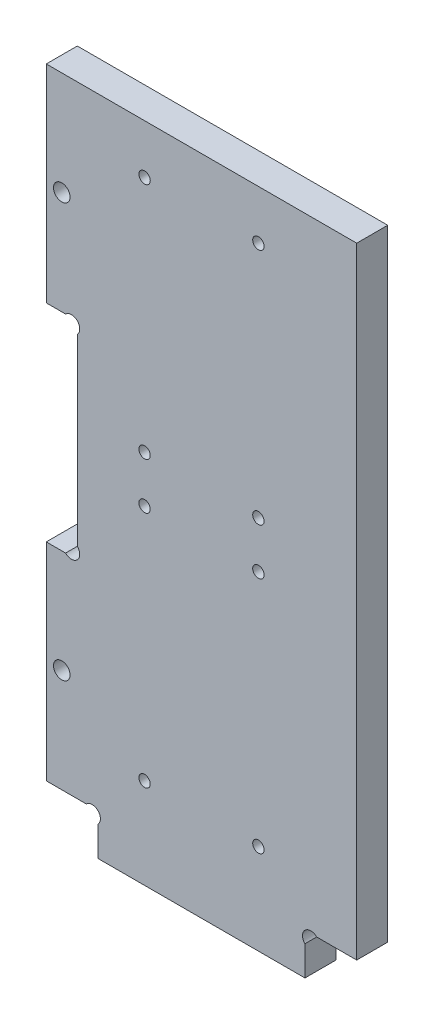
from build123d import *

# Parameters (mm, degrees)
ESQUISSE1_R      = 1.1
ESQUISSE1_R_2    = 1.6
EXTRUSION1_DEPTH = 6


with BuildPart() as part:
    # Esquisse1 → Extrusion1 (new body)
    with BuildSketch(Plane.XY):
        with BuildLine():
            Line((0, 10), (0, 50))
            Line((0, 50), (3.7372583, 50))
            ThreePointArc((3.7372583, 50), (6, 50), (6, 52.2627417))
            Line((6, 52.2627417), (6, 87.7372583))
            ThreePointArc((6, 87.7372583), (6, 90), (3.7372583, 90))
            Line((3.7372583, 90), (0, 90))
            Line((0, 90), (0, 130))
            Line((0, 130), (60, 130))
            Line((60, 130), (60, 10))
            Line((60, 10), (52.2627417, 10))
            ThreePointArc((52.2627417, 10), (50, 10), (50, 7.7372583))
            Line((50, 7.7372583), (50, 2))
            Line((50, 2), (10, 2))
            Line((10, 2), (10, 7.7372583))
            ThreePointArc((10, 7.7372583), (10, 10), (7.7372583, 10))
            Line((7.7372583, 10), (0, 10))
        make_face()
        with Locations((19, 120.5)):
            Circle(ESQUISSE1_R, mode=Mode.SUBTRACT)
        with Locations((19, 74.5)):
            Circle(ESQUISSE1_R, mode=Mode.SUBTRACT)
        with Locations(Location((41, 74.5, 0), (0, 0, 180))):
            Circle(ESQUISSE1_R, mode=Mode.SUBTRACT)
        with Locations(Location((41, 120.5, 0), (0, 0, 180))):
            Circle(ESQUISSE1_R, mode=Mode.SUBTRACT)
        with Locations(Location((19, 65.5, 0), (0, 0, 180))):
            Circle(ESQUISSE1_R, mode=Mode.SUBTRACT)
        with Locations((41, 65.5)):
            Circle(ESQUISSE1_R, mode=Mode.SUBTRACT)
        with Locations((41, 19.5)):
            Circle(ESQUISSE1_R, mode=Mode.SUBTRACT)
        with Locations(Location((19, 19.5, 0), (0, 0, 180))):
            Circle(ESQUISSE1_R, mode=Mode.SUBTRACT)
        with Locations((3, 110)):
            Circle(ESQUISSE1_R_2, mode=Mode.SUBTRACT)
        with Locations(Location((3, 30, 0), (0, 0, 180))):
            Circle(ESQUISSE1_R_2, mode=Mode.SUBTRACT)
    extrude(amount=EXTRUSION1_DEPTH)


solid = part.part
